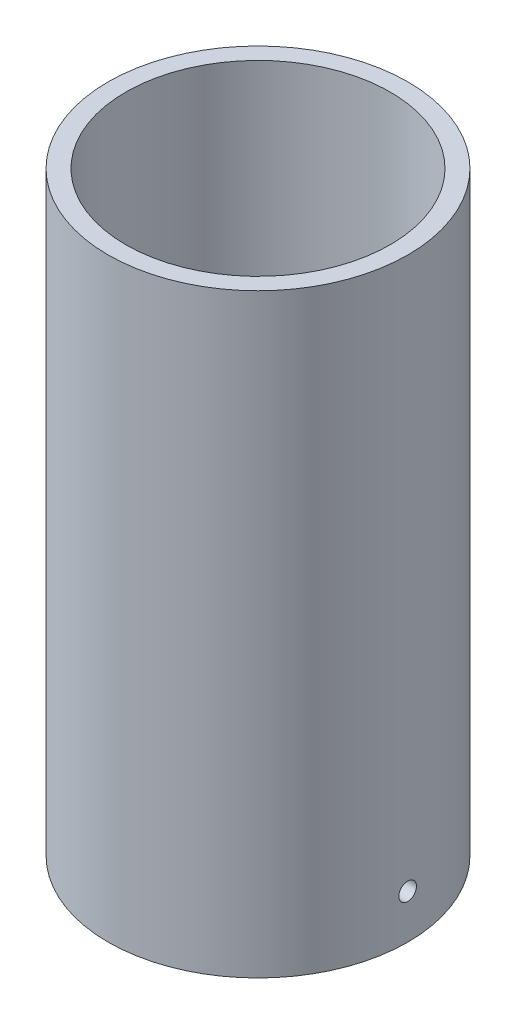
ISO-10303-21;
HEADER;
FILE_DESCRIPTION(('STEP AP214'),'2;1');
FILE_NAME('part.step','',(''),(''),'','','');
FILE_SCHEMA(('AUTOMOTIVE_DESIGN { 1 0 10303 214 1 1 1 1 }'));
ENDSEC;
DATA;
#1=APPLICATION_CONTEXT('core data for automotive mechanical design processes');
#2=APPLICATION_PROTOCOL_DEFINITION('international standard','automotive_design',2000,#1);
#3=PRODUCT_CONTEXT('',#1,'mechanical');
#4=PRODUCT('Part','Part','',(#3));
#5=PRODUCT_RELATED_PRODUCT_CATEGORY('part','',(#4));
#6=PRODUCT_DEFINITION_FORMATION('','',#4);
#7=PRODUCT_DEFINITION_CONTEXT('part definition',#1,'design');
#8=PRODUCT_DEFINITION('design','',#6,#7);
#9=PRODUCT_DEFINITION_SHAPE('','',#8);
#10=(LENGTH_UNIT() NAMED_UNIT(*) SI_UNIT(.MILLI.,.METRE.));
#11=(NAMED_UNIT(*) PLANE_ANGLE_UNIT() SI_UNIT($,.RADIAN.));
#12=(NAMED_UNIT(*) SI_UNIT($,.STERADIAN.) SOLID_ANGLE_UNIT());
#13=UNCERTAINTY_MEASURE_WITH_UNIT(LENGTH_MEASURE(1.E-05),#10,'distance_accuracy_value','');
#14=(GEOMETRIC_REPRESENTATION_CONTEXT(3) GLOBAL_UNCERTAINTY_ASSIGNED_CONTEXT((#13)) GLOBAL_UNIT_ASSIGNED_CONTEXT((#10,
#11,#12)) REPRESENTATION_CONTEXT('',''));
#15=CARTESIAN_POINT('',(0.,0.,0.));
#16=DIRECTION('',(0.,0.,1.));
#17=DIRECTION('',(1.,0.,0.));
#18=AXIS2_PLACEMENT_3D('',#15,#16,#17);
#19=CARTESIAN_POINT('',(0.,171.45,0.));
#20=DIRECTION('',(0.,-1.,0.));
#21=DIRECTION('',(0.,0.,-1.));
#22=AXIS2_PLACEMENT_3D('',#19,#20,#21);
#23=CYLINDRICAL_SURFACE('',#22,43.18);
#24=CARTESIAN_POINT('',(43.1052293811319,12.7,-2.54));
#25=CARTESIAN_POINT('',(43.1052303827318,12.8425404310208,-2.53999372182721));
#26=CARTESIAN_POINT('',(43.1059440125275,12.9851810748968,-2.52796099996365));
#27=CARTESIAN_POINT('',(43.1087218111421,13.2665248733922,-2.48013215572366));
#28=CARTESIAN_POINT('',(43.1107875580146,13.4052232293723,-2.4443082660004));
#29=CARTESIAN_POINT('',(43.1160347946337,13.674566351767,-2.34992858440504));
#30=CARTESIAN_POINT('',(43.1192157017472,13.8052152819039,-2.29138466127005));
#31=CARTESIAN_POINT('',(43.1263341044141,14.054797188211,-2.15324565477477));
#32=CARTESIAN_POINT('',(43.1302714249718,14.1737328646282,-2.07365543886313));
#33=CARTESIAN_POINT('',(43.1384650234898,14.3967069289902,-1.89556508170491));
#34=CARTESIAN_POINT('',(43.1427216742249,14.5007274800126,-1.79704262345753));
#35=CARTESIAN_POINT('',(43.1510708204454,14.6907660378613,-1.58393015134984));
#36=CARTESIAN_POINT('',(43.1551633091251,14.776783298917,-1.46933947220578));
#37=CARTESIAN_POINT('',(43.1627261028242,14.9284266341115,-1.22724493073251));
#38=CARTESIAN_POINT('',(43.1661959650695,14.9940382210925,-1.0997319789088));
#39=CARTESIAN_POINT('',(43.1721186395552,15.1029149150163,-0.835476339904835));
#40=CARTESIAN_POINT('',(43.1745714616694,15.1461802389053,-0.698733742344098));
#41=CARTESIAN_POINT('',(43.1781811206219,15.2090875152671,-0.420069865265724));
#42=CARTESIAN_POINT('',(43.1793394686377,15.2287570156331,-0.278154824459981));
#43=CARTESIAN_POINT('',(43.1802347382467,15.243999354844,0.00696705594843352));
#44=CARTESIAN_POINT('',(43.1799716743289,15.2395724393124,0.150173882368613));
#45=CARTESIAN_POINT('',(43.1780550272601,15.2067703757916,0.433627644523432));
#46=CARTESIAN_POINT('',(43.176403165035,15.1784248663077,0.573878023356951));
#47=CARTESIAN_POINT('',(43.171896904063,15.0986362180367,0.847626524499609));
#48=CARTESIAN_POINT('',(43.1690424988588,15.0471929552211,0.981124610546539));
#49=CARTESIAN_POINT('',(43.1624496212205,14.9226354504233,1.23767424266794));
#50=CARTESIAN_POINT('',(43.1587106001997,14.8495077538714,1.36071924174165));
#51=CARTESIAN_POINT('',(43.1507693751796,14.6836670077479,1.59279838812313));
#52=CARTESIAN_POINT('',(43.1465671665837,14.590953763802,1.7018323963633));
#53=CARTESIAN_POINT('',(43.1381650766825,14.3884062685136,1.90296743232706));
#54=CARTESIAN_POINT('',(43.1339652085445,14.2785462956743,1.99504256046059));
#55=CARTESIAN_POINT('',(43.1260476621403,14.04491405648,2.15944652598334));
#56=CARTESIAN_POINT('',(43.1223299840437,13.9211417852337,2.2317753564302));
#57=CARTESIAN_POINT('',(43.1157965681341,13.6631821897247,2.35463160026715));
#58=CARTESIAN_POINT('',(43.1129808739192,13.5289943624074,2.40515795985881));
#59=CARTESIAN_POINT('',(43.1085705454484,13.2540201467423,2.48295730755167));
#60=CARTESIAN_POINT('',(43.1069758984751,13.1132338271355,2.51023053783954));
#61=CARTESIAN_POINT('',(43.1051898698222,12.8292848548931,2.54071724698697));
#62=CARTESIAN_POINT('',(43.104996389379,12.6861260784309,2.54396671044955));
#63=CARTESIAN_POINT('',(43.1060290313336,12.4012974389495,2.5264076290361));
#64=CARTESIAN_POINT('',(43.1072551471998,12.2596275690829,2.50559919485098));
#65=CARTESIAN_POINT('',(43.1109868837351,11.9818997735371,2.44054487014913));
#66=CARTESIAN_POINT('',(43.1134916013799,11.845837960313,2.39631552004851));
#67=CARTESIAN_POINT('',(43.1194974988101,11.5830686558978,2.2856916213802));
#68=CARTESIAN_POINT('',(43.1229986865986,11.4563612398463,2.21929689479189));
#69=CARTESIAN_POINT('',(43.1306080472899,11.2157321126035,2.0661348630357));
#70=CARTESIAN_POINT('',(43.1347169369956,11.1018257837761,1.97934342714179));
#71=CARTESIAN_POINT('',(43.143076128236,10.8901870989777,1.787886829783));
#72=CARTESIAN_POINT('',(43.1473264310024,10.7924548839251,1.68322151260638));
#73=CARTESIAN_POINT('',(43.1554956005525,10.6158173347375,1.45883344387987));
#74=CARTESIAN_POINT('',(43.1594140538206,10.5369352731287,1.33909235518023));
#75=CARTESIAN_POINT('',(43.1664720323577,10.4003964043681,1.08804411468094));
#76=CARTESIAN_POINT('',(43.1696115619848,10.342739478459,0.956737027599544));
#77=CARTESIAN_POINT('',(43.174755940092,10.2503280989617,0.686369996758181));
#78=CARTESIAN_POINT('',(43.1767615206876,10.2155588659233,0.547315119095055));
#79=CARTESIAN_POINT('',(43.1794149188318,10.1698614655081,0.265329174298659));
#80=CARTESIAN_POINT('',(43.1800627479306,10.1589330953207,0.122398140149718));
#81=CARTESIAN_POINT('',(43.1799276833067,10.1612295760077,-0.163052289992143));
#82=CARTESIAN_POINT('',(43.1791469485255,10.1744179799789,-0.305571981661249));
#83=CARTESIAN_POINT('',(43.1762468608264,10.224498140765,-0.586369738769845));
#84=CARTESIAN_POINT('',(43.1741275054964,10.261389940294,-0.724647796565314));
#85=CARTESIAN_POINT('',(43.1687884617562,10.3578216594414,-0.993043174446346));
#86=CARTESIAN_POINT('',(43.165568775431,10.4173615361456,-1.12316050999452));
#87=CARTESIAN_POINT('',(43.1583907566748,10.5573939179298,-1.37155604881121));
#88=CARTESIAN_POINT('',(43.1544324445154,10.6378858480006,-1.48983457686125));
#89=CARTESIAN_POINT('',(43.1462154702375,10.8176711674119,-1.71137919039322));
#90=CARTESIAN_POINT('',(43.1419563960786,10.9169906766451,-1.81462406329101));
#91=CARTESIAN_POINT('',(43.1336210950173,11.1315810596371,-2.00300983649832));
#92=CARTESIAN_POINT('',(43.1295449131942,11.2468558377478,-2.08814629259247));
#93=CARTESIAN_POINT('',(43.1220316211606,11.4902031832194,-2.23795419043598));
#94=CARTESIAN_POINT('',(43.1185952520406,11.618290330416,-2.30260196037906));
#95=CARTESIAN_POINT('',(43.112760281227,11.8834270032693,-2.40939581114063));
#96=CARTESIAN_POINT('',(43.110360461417,12.0204657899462,-2.45156831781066));
#97=CARTESIAN_POINT('',(43.1075009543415,12.2486226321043,-2.50122140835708));
#98=CARTESIAN_POINT('',(43.1066529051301,12.3382648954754,-2.5157446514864));
#99=CARTESIAN_POINT('',(43.1055168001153,12.5185912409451,-2.53513593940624));
#100=CARTESIAN_POINT('',(43.1052287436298,12.6092753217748,-2.54000399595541));
#101=CARTESIAN_POINT('',(43.1052293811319,12.7,-2.54));
#102=B_SPLINE_CURVE_WITH_KNOTS('',3,(#24,#25,#26,#27,#28,#29,#30,#31,#32,#33,#34,#35,#36,#37,
#38,#39,#40,#41,#42,#43,#44,#45,#46,#47,#48,#49,#50,#51,#52,#53,#54,#55,#56,#57,#58,#59,#60,#61,
#62,#63,#64,#65,#66,#67,#68,#69,#70,#71,#72,#73,#74,#75,#76,#77,#78,#79,#80,#81,#82,#83,#84,#85,
#86,#87,#88,#89,#90,#91,#92,#93,#94,#95,#96,#97,#98,#99,#100,#101),.UNSPECIFIED.,.T.,.F.,(4,2,2,
2,2,2,2,2,2,2,2,2,2,2,2,2,2,2,2,2,2,2,2,2,2,2,2,2,2,2,2,2,2,2,2,2,2,2,4),(0.,0.427290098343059,
0.855079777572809,1.28264628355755,1.7101139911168,2.13808871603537,2.56608116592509,
2.9943767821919,3.42266824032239,3.85045918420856,4.2782457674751,4.70550304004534,
5.13276260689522,5.56028783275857,5.98781730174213,6.41599437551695,6.84417159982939,
7.27236951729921,7.70056297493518,8.12811492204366,8.55566490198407,8.98291333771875,
9.41016520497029,9.83792510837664,10.2656887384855,10.6939777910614,11.1222644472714,
11.5502742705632,11.9782804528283,12.4056403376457,12.8330009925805,13.2603608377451,
13.6877089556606,14.1156543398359,14.5437046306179,14.9722476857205,15.4002857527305,
15.6722493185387,15.9442125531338),.UNSPECIFIED.);
#103=CARTESIAN_POINT('',(43.1052293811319,12.7,-2.54));
#104=VERTEX_POINT('',#103);
#105=EDGE_CURVE('E45',#104,#104,#102,.T.);
#106=ORIENTED_EDGE('',*,*,#105,.F.);
#107=EDGE_LOOP('',(#106));
#108=FACE_BOUND('',#107,.T.);
#109=CARTESIAN_POINT('',(0.,171.45,0.));
#110=DIRECTION('',(0.,1.,0.));
#111=DIRECTION('',(0.,0.,1.));
#112=AXIS2_PLACEMENT_3D('',#109,#110,#111);
#113=CIRCLE('',#112,43.18);
#114=CARTESIAN_POINT('',(0.,171.45,43.18));
#115=VERTEX_POINT('',#114);
#116=EDGE_CURVE('E10',#115,#115,#113,.T.);
#117=ORIENTED_EDGE('',*,*,#116,.F.);
#118=EDGE_LOOP('',(#117));
#119=FACE_BOUND('',#118,.T.);
#120=CARTESIAN_POINT('',(0.,0.,0.));
#121=DIRECTION('',(0.,1.,0.));
#122=DIRECTION('',(0.,0.,1.));
#123=AXIS2_PLACEMENT_3D('',#120,#121,#122);
#124=CIRCLE('',#123,43.18);
#125=CARTESIAN_POINT('',(0.,0.,43.18));
#126=VERTEX_POINT('',#125);
#127=EDGE_CURVE('E33',#126,#126,#124,.T.);
#128=ORIENTED_EDGE('',*,*,#127,.T.);
#129=EDGE_LOOP('',(#128));
#130=FACE_BOUND('',#129,.T.);
#131=ADVANCED_FACE('F30',(#108,#119,#130),#23,.T.);
#132=CARTESIAN_POINT('',(0.,171.45,0.));
#133=DIRECTION('',(0.,1.,0.));
#134=DIRECTION('',(0.,0.,1.));
#135=AXIS2_PLACEMENT_3D('',#132,#133,#134);
#136=PLANE('',#135);
#137=CARTESIAN_POINT('',(0.,171.45,0.));
#138=DIRECTION('',(0.,1.,0.));
#139=DIRECTION('',(0.,0.,1.));
#140=AXIS2_PLACEMENT_3D('',#137,#138,#139);
#141=CIRCLE('',#140,38.1);
#142=CARTESIAN_POINT('',(0.,171.45,38.1));
#143=VERTEX_POINT('',#142);
#144=EDGE_CURVE('E42',#143,#143,#141,.T.);
#145=ORIENTED_EDGE('',*,*,#144,.F.);
#146=EDGE_LOOP('',(#145));
#147=FACE_BOUND('',#146,.T.);
#148=ORIENTED_EDGE('',*,*,#116,.T.);
#149=EDGE_LOOP('',(#148));
#150=FACE_BOUND('',#149,.T.);
#151=ADVANCED_FACE('F69',(#147,#150),#136,.T.);
#152=CARTESIAN_POINT('',(0.,0.,0.));
#153=DIRECTION('',(0.,1.,0.));
#154=DIRECTION('',(0.,0.,1.));
#155=AXIS2_PLACEMENT_3D('',#152,#153,#154);
#156=PLANE('',#155);
#157=CARTESIAN_POINT('',(0.,0.,0.));
#158=DIRECTION('',(0.,1.,0.));
#159=DIRECTION('',(0.,0.,1.));
#160=AXIS2_PLACEMENT_3D('',#157,#158,#159);
#161=CIRCLE('',#160,38.1);
#162=CARTESIAN_POINT('',(0.,0.,38.1));
#163=VERTEX_POINT('',#162);
#164=EDGE_CURVE('E40',#163,#163,#161,.T.);
#165=ORIENTED_EDGE('',*,*,#164,.T.);
#166=EDGE_LOOP('',(#165));
#167=FACE_BOUND('',#166,.T.);
#168=ORIENTED_EDGE('',*,*,#127,.F.);
#169=EDGE_LOOP('',(#168));
#170=FACE_BOUND('',#169,.T.);
#171=ADVANCED_FACE('F67',(#167,#170),#156,.F.);
#172=CARTESIAN_POINT('',(0.,0.,0.));
#173=DIRECTION('',(0.,1.,0.));
#174=DIRECTION('',(0.,0.,1.));
#175=AXIS2_PLACEMENT_3D('',#172,#173,#174);
#176=CYLINDRICAL_SURFACE('',#175,38.1);
#177=CARTESIAN_POINT('',(38.0152390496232,12.7,-2.54));
#178=CARTESIAN_POINT('',(38.0152401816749,12.5574972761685,-2.53999373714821));
#179=CARTESIAN_POINT('',(38.0160489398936,12.4148952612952,-2.52796735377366));
#180=CARTESIAN_POINT('',(38.0191968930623,12.1336302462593,-2.48016515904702));
#181=CARTESIAN_POINT('',(38.0215378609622,11.9949720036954,-2.44436183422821));
#182=CARTESIAN_POINT('',(38.0274839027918,11.7257093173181,-2.35003998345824));
#183=CARTESIAN_POINT('',(38.0310883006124,11.5951006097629,-2.29153360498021));
#184=CARTESIAN_POINT('',(38.0391542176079,11.3455912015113,-2.15348644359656));
#185=CARTESIAN_POINT('',(38.0436155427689,11.2266878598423,-2.07395042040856));
#186=CARTESIAN_POINT('',(38.0529011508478,11.0037296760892,-1.89595474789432));
#187=CARTESIAN_POINT('',(38.0577259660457,10.8996972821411,-1.79746700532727));
#188=CARTESIAN_POINT('',(38.0671899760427,10.7096263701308,-1.58442193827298));
#189=CARTESIAN_POINT('',(38.0718291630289,10.6235886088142,-1.4698639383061));
#190=CARTESIAN_POINT('',(38.0804038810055,10.4718791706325,-1.22780216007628));
#191=CARTESIAN_POINT('',(38.0843387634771,10.4062262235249,-1.10028661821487));
#192=CARTESIAN_POINT('',(38.0910558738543,10.2972699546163,-0.836011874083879));
#193=CARTESIAN_POINT('',(38.0938381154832,10.2539663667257,-0.699252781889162));
#194=CARTESIAN_POINT('',(38.0979327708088,10.1910007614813,-0.420590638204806));
#195=CARTESIAN_POINT('',(38.0992473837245,10.1713033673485,-0.27869561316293));
#196=CARTESIAN_POINT('',(38.1002660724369,10.1560000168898,0.0063923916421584));
#197=CARTESIAN_POINT('',(38.0999701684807,10.1603937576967,0.149585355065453));
#198=CARTESIAN_POINT('',(38.0978029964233,10.1931188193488,0.432964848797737));
#199=CARTESIAN_POINT('',(38.0959342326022,10.2214120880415,0.573155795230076));
#200=CARTESIAN_POINT('',(38.0908345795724,10.3010739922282,0.846794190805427));
#201=CARTESIAN_POINT('',(38.0876036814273,10.3524427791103,0.98024159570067));
#202=CARTESIAN_POINT('',(38.0801391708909,10.4768405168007,1.23672679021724));
#203=CARTESIAN_POINT('',(38.0759047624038,10.5498866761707,1.35975620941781));
#204=CARTESIAN_POINT('',(38.066909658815,10.7155531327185,1.59182167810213));
#205=CARTESIAN_POINT('',(38.0621489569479,10.8081736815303,1.70085754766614));
#206=CARTESIAN_POINT('',(38.0526259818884,11.0105745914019,1.90206295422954));
#207=CARTESIAN_POINT('',(38.0478637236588,11.1203879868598,1.99419926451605));
#208=CARTESIAN_POINT('',(38.0388837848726,11.3539417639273,2.15873386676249));
#209=CARTESIAN_POINT('',(38.0346661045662,11.4776821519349,2.23113214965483));
#210=CARTESIAN_POINT('',(38.0272516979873,11.7355988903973,2.35413340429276));
#211=CARTESIAN_POINT('',(38.0240550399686,11.8697759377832,2.40473491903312));
#212=CARTESIAN_POINT('',(38.0190455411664,12.1447472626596,2.4826830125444));
#213=CARTESIAN_POINT('',(38.0172326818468,12.2855414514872,2.51002990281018));
#214=CARTESIAN_POINT('',(38.0151987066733,12.5694604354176,2.54065095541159));
#215=CARTESIAN_POINT('',(38.0149745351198,12.7125802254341,2.54397133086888));
#216=CARTESIAN_POINT('',(38.0161352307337,12.9973426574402,2.52656589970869));
#217=CARTESIAN_POINT('',(38.0175200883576,13.138985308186,2.50584023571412));
#218=CARTESIAN_POINT('',(38.0217399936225,13.4166417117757,2.44096946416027));
#219=CARTESIAN_POINT('',(38.0245737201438,13.5526604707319,2.39684569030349));
#220=CARTESIAN_POINT('',(38.0313709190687,13.8153626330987,2.28645283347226));
#221=CARTESIAN_POINT('',(38.0353344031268,13.9420459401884,2.2201835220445));
#222=CARTESIAN_POINT('',(38.0439518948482,14.1826932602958,2.06726284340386));
#223=CARTESIAN_POINT('',(38.048606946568,14.2966375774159,1.98058054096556));
#224=CARTESIAN_POINT('',(38.0580793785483,14.5083739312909,1.78933943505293));
#225=CARTESIAN_POINT('',(38.0628967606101,14.6061657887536,1.68478043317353));
#226=CARTESIAN_POINT('',(38.0721599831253,14.7829776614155,1.46055493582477));
#227=CARTESIAN_POINT('',(38.0766052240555,14.8619677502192,1.34086481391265));
#228=CARTESIAN_POINT('',(38.0846146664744,14.998728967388,1.08989325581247));
#229=CARTESIAN_POINT('',(38.0881788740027,15.0565002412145,0.958611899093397));
#230=CARTESIAN_POINT('',(38.0940218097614,15.1491319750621,0.688293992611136));
#231=CARTESIAN_POINT('',(38.0963015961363,15.1840112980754,0.54926393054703));
#232=CARTESIAN_POINT('',(38.0993230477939,15.2299307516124,0.267305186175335));
#233=CARTESIAN_POINT('',(38.1000647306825,15.240971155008,0.124376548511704));
#234=CARTESIAN_POINT('',(38.0999264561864,15.2388966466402,-0.161026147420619));
#235=CARTESIAN_POINT('',(38.0990496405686,15.2258285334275,-0.303500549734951));
#236=CARTESIAN_POINT('',(38.0957791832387,15.1760050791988,-0.584227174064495));
#237=CARTESIAN_POINT('',(38.0933855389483,15.1392496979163,-0.722479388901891));
#238=CARTESIAN_POINT('',(38.0873503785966,15.04310588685,-0.99084342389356));
#239=CARTESIAN_POINT('',(38.0837088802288,14.9837177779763,-1.12095535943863));
#240=CARTESIAN_POINT('',(38.0755866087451,14.8440005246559,-1.36936803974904));
#241=CARTESIAN_POINT('',(38.0711058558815,14.763671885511,-1.48766906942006));
#242=CARTESIAN_POINT('',(38.0617985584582,14.5841799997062,-1.70933977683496));
#243=CARTESIAN_POINT('',(38.0569713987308,14.4849827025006,-1.81268185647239));
#244=CARTESIAN_POINT('',(38.0475203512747,14.2706192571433,-2.00128399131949));
#245=CARTESIAN_POINT('',(38.0428965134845,14.1554492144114,-2.08653962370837));
#246=CARTESIAN_POINT('',(38.0343687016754,13.9122619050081,-2.236620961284));
#247=CARTESIAN_POINT('',(38.0304657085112,13.7842274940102,-2.30141891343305));
#248=CARTESIAN_POINT('',(38.0238339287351,13.5191624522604,-2.40851811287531));
#249=CARTESIAN_POINT('',(38.0211037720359,13.3821425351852,-2.45084562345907));
#250=CARTESIAN_POINT('',(38.017839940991,13.153574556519,-2.50084005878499));
#251=CARTESIAN_POINT('',(38.0168689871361,13.0635027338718,-2.51550595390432));
#252=CARTESIAN_POINT('',(38.0155681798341,12.8823008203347,-2.53508792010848));
#253=CARTESIAN_POINT('',(38.0152383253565,12.7911707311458,-2.5400040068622));
#254=CARTESIAN_POINT('',(38.0152390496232,12.7,-2.54));
#255=B_SPLINE_CURVE_WITH_KNOTS('',3,(#177,#178,#179,#180,#181,#182,#183,#184,#185,#186,#187,
#188,#189,#190,#191,#192,#193,#194,#195,#196,#197,#198,#199,#200,#201,#202,#203,#204,#205,#206,
#207,#208,#209,#210,#211,#212,#213,#214,#215,#216,#217,#218,#219,#220,#221,#222,#223,#224,#225,
#226,#227,#228,#229,#230,#231,#232,#233,#234,#235,#236,#237,#238,#239,#240,#241,#242,#243,#244,
#245,#246,#247,#248,#249,#250,#251,#252,#253,#254),.UNSPECIFIED.,.T.,.F.,(4,2,2,2,2,2,2,2,2,2,2,
2,2,2,2,2,2,2,2,2,2,2,2,2,2,2,2,2,2,2,2,2,2,2,2,2,2,2,4),(0.,0.427175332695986,
0.854845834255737,1.28228782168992,1.70963314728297,2.13761690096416,2.56561864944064,
2.99401249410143,3.42240123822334,3.85014718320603,4.27788775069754,4.70494856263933,
5.13201217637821,5.55941572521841,5.98682476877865,6.41506535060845,6.84330612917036,
7.2715755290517,7.69983919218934,8.12727890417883,8.55471608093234,8.98176420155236,
9.40881672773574,9.83652065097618,10.2642293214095,10.6926142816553,11.120996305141,
11.5490248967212,11.9770485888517,12.4042422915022,12.8314367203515,13.2586250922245,
13.6858031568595,14.1137595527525,14.5418204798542,14.9704596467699,15.3985967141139,
15.6718964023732,15.9451956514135),.UNSPECIFIED.);
#256=CARTESIAN_POINT('',(38.0152390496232,12.7,-2.54));
#257=VERTEX_POINT('',#256);
#258=EDGE_CURVE('E55',#257,#257,#255,.T.);
#259=ORIENTED_EDGE('',*,*,#258,.F.);
#260=EDGE_LOOP('',(#259));
#261=FACE_BOUND('',#260,.T.);
#262=ORIENTED_EDGE('',*,*,#164,.F.);
#263=EDGE_LOOP('',(#262));
#264=FACE_BOUND('',#263,.T.);
#265=ORIENTED_EDGE('',*,*,#144,.T.);
#266=EDGE_LOOP('',(#265));
#267=FACE_BOUND('',#266,.T.);
#268=ADVANCED_FACE('F64',(#261,#264,#267),#176,.F.);
#269=CARTESIAN_POINT('',(-43.181,12.7,0.));
#270=DIRECTION('',(1.,0.,0.));
#271=DIRECTION('',(0.,0.,-1.));
#272=AXIS2_PLACEMENT_3D('',#269,#270,#271);
#273=CYLINDRICAL_SURFACE('',#272,2.54);
#274=ORIENTED_EDGE('',*,*,#258,.T.);
#275=EDGE_LOOP('',(#274));
#276=FACE_BOUND('',#275,.T.);
#277=ORIENTED_EDGE('',*,*,#105,.T.);
#278=EDGE_LOOP('',(#277));
#279=FACE_BOUND('',#278,.T.);
#280=ADVANCED_FACE('F60',(#276,#279),#273,.F.);
#281=CLOSED_SHELL('',(#131,#151,#171,#268,#280));
#282=MANIFOLD_SOLID_BREP('B2',#281);
#283=ADVANCED_BREP_SHAPE_REPRESENTATION('',(#18,#282),#14);
#284=SHAPE_DEFINITION_REPRESENTATION(#9,#283);
ENDSEC;
END-ISO-10303-21;
